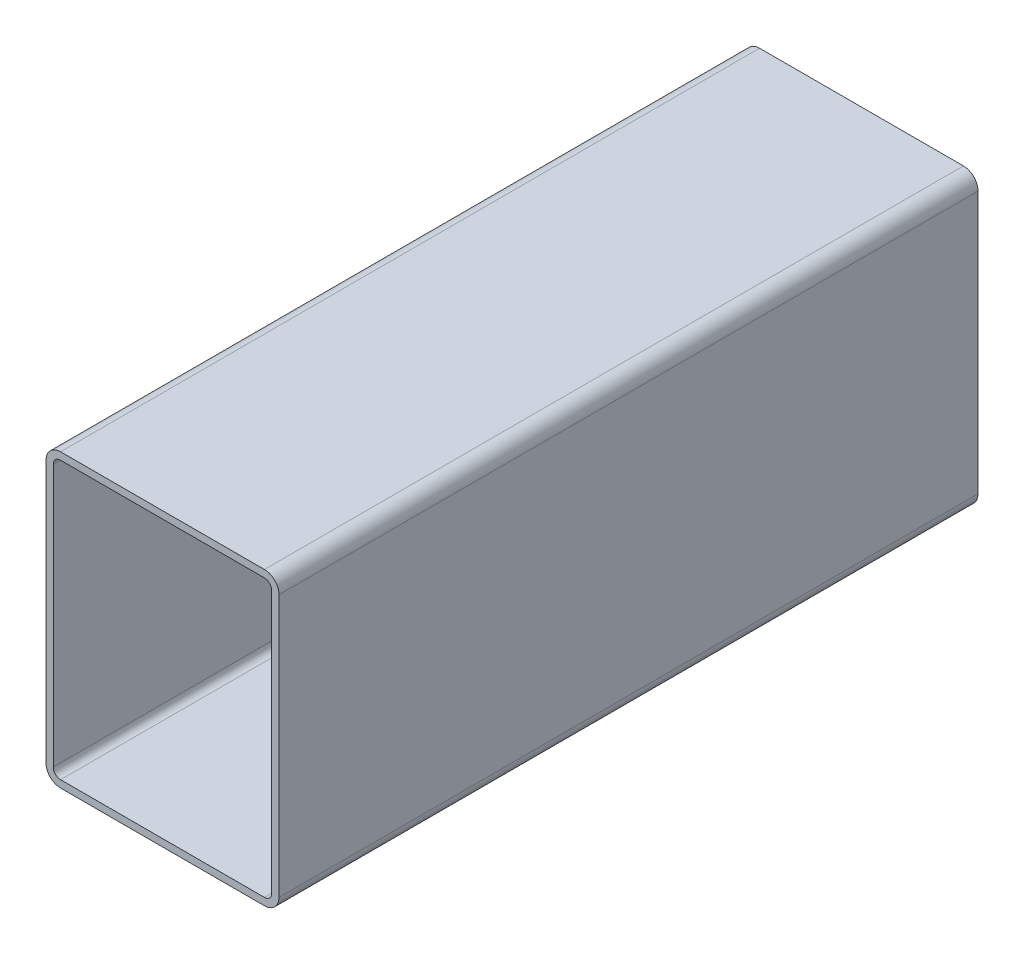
ISO-10303-21;
HEADER;
FILE_DESCRIPTION(('STEP AP214'),'2;1');
FILE_NAME('part.step','',(''),(''),'','','');
FILE_SCHEMA(('AUTOMOTIVE_DESIGN { 1 0 10303 214 1 1 1 1 }'));
ENDSEC;
DATA;
#1=APPLICATION_CONTEXT('core data for automotive mechanical design processes');
#2=APPLICATION_PROTOCOL_DEFINITION('international standard','automotive_design',2000,#1);
#3=PRODUCT_CONTEXT('',#1,'mechanical');
#4=PRODUCT('Part','Part','',(#3));
#5=PRODUCT_RELATED_PRODUCT_CATEGORY('part','',(#4));
#6=PRODUCT_DEFINITION_FORMATION('','',#4);
#7=PRODUCT_DEFINITION_CONTEXT('part definition',#1,'design');
#8=PRODUCT_DEFINITION('design','',#6,#7);
#9=PRODUCT_DEFINITION_SHAPE('','',#8);
#10=(LENGTH_UNIT() NAMED_UNIT(*) SI_UNIT(.MILLI.,.METRE.));
#11=(NAMED_UNIT(*) PLANE_ANGLE_UNIT() SI_UNIT($,.RADIAN.));
#12=(NAMED_UNIT(*) SI_UNIT($,.STERADIAN.) SOLID_ANGLE_UNIT());
#13=UNCERTAINTY_MEASURE_WITH_UNIT(LENGTH_MEASURE(1.E-05),#10,'distance_accuracy_value','');
#14=(GEOMETRIC_REPRESENTATION_CONTEXT(3) GLOBAL_UNCERTAINTY_ASSIGNED_CONTEXT((#13)) GLOBAL_UNIT_ASSIGNED_CONTEXT((#10,
#11,#12)) REPRESENTATION_CONTEXT('',''));
#15=CARTESIAN_POINT('',(0.,0.,0.));
#16=DIRECTION('',(0.,0.,1.));
#17=DIRECTION('',(1.,0.,0.));
#18=AXIS2_PLACEMENT_3D('',#15,#16,#17);
#19=CARTESIAN_POINT('',(8.02517782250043,122.68485662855,304.8));
#20=DIRECTION('',(0.,0.,1.));
#21=DIRECTION('',(1.,0.,0.));
#22=AXIS2_PLACEMENT_3D('',#19,#20,#21);
#23=PLANE('',#22);
#24=CARTESIAN_POINT('',(8.02517782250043,122.68485662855,304.8));
#25=DIRECTION('',(0.,0.,1.));
#26=DIRECTION('',(1.,0.,0.));
#27=AXIS2_PLACEMENT_3D('',#24,#25,#26);
#28=CIRCLE('',#27,6.35);
#29=CARTESIAN_POINT('',(8.02517782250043,129.03485662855,304.8));
#30=VERTEX_POINT('',#29);
#31=CARTESIAN_POINT('',(1.67517782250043,122.68485662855,304.8));
#32=VERTEX_POINT('',#31);
#33=EDGE_CURVE('E211',#30,#32,#28,.T.);
#34=ORIENTED_EDGE('',*,*,#33,.T.);
#35=DIRECTION('',(0.,-1.,0.));
#36=VECTOR('',#35,1.);
#37=CARTESIAN_POINT('',(1.67517782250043,8.38485662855,304.8));
#38=LINE('',#37,#36);
#39=CARTESIAN_POINT('',(1.67517782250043,8.38485662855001,304.8));
#40=VERTEX_POINT('',#39);
#41=EDGE_CURVE('E214',#32,#40,#38,.T.);
#42=ORIENTED_EDGE('',*,*,#41,.T.);
#43=CARTESIAN_POINT('',(8.02517782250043,8.38485662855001,304.8));
#44=DIRECTION('',(0.,0.,1.));
#45=DIRECTION('',(1.,0.,0.));
#46=AXIS2_PLACEMENT_3D('',#43,#44,#45);
#47=CIRCLE('',#46,6.35);
#48=CARTESIAN_POINT('',(8.02517782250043,2.03485662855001,304.8));
#49=VERTEX_POINT('',#48);
#50=EDGE_CURVE('E217',#40,#49,#47,.T.);
#51=ORIENTED_EDGE('',*,*,#50,.T.);
#52=DIRECTION('',(1.,0.,0.));
#53=VECTOR('',#52,1.);
#54=CARTESIAN_POINT('',(96.9251778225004,2.03485662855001,304.8));
#55=LINE('',#54,#53);
#56=CARTESIAN_POINT('',(96.9251778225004,2.03485662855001,304.8));
#57=VERTEX_POINT('',#56);
#58=EDGE_CURVE('E219',#49,#57,#55,.T.);
#59=ORIENTED_EDGE('',*,*,#58,.T.);
#60=CARTESIAN_POINT('',(96.9251778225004,8.38485662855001,304.8));
#61=DIRECTION('',(0.,0.,1.));
#62=DIRECTION('',(1.,0.,0.));
#63=AXIS2_PLACEMENT_3D('',#60,#61,#62);
#64=CIRCLE('',#63,6.35);
#65=CARTESIAN_POINT('',(103.2751778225,8.38485662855,304.8));
#66=VERTEX_POINT('',#65);
#67=EDGE_CURVE('E221',#57,#66,#64,.T.);
#68=ORIENTED_EDGE('',*,*,#67,.T.);
#69=DIRECTION('',(0.,1.,0.));
#70=VECTOR('',#69,1.);
#71=CARTESIAN_POINT('',(103.2751778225,122.68485662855,304.8));
#72=LINE('',#71,#70);
#73=CARTESIAN_POINT('',(103.2751778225,122.68485662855,304.8));
#74=VERTEX_POINT('',#73);
#75=EDGE_CURVE('E223',#66,#74,#72,.T.);
#76=ORIENTED_EDGE('',*,*,#75,.T.);
#77=CARTESIAN_POINT('',(96.9251778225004,122.68485662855,304.8));
#78=DIRECTION('',(0.,0.,1.));
#79=DIRECTION('',(1.,0.,0.));
#80=AXIS2_PLACEMENT_3D('',#77,#78,#79);
#81=CIRCLE('',#80,6.34999999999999);
#82=CARTESIAN_POINT('',(96.9251778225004,129.03485662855,304.8));
#83=VERTEX_POINT('',#82);
#84=EDGE_CURVE('E225',#74,#83,#81,.T.);
#85=ORIENTED_EDGE('',*,*,#84,.T.);
#86=DIRECTION('',(-1.,0.,0.));
#87=VECTOR('',#86,1.);
#88=CARTESIAN_POINT('',(8.02517782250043,129.03485662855,304.8));
#89=LINE('',#88,#87);
#90=EDGE_CURVE('E227',#83,#30,#89,.T.);
#91=ORIENTED_EDGE('',*,*,#90,.T.);
#92=EDGE_LOOP('',(#34,#42,#51,#59,#68,#76,#85,#91));
#93=FACE_BOUND('',#92,.T.);
#94=DIRECTION('',(0.,-1.,0.));
#95=VECTOR('',#94,1.);
#96=CARTESIAN_POINT('',(4.85017782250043,8.38485662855,304.8));
#97=LINE('',#96,#95);
#98=CARTESIAN_POINT('',(4.85017782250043,122.68485662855,304.8));
#99=VERTEX_POINT('',#98);
#100=CARTESIAN_POINT('',(4.85017782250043,8.38485662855,304.8));
#101=VERTEX_POINT('',#100);
#102=EDGE_CURVE('E154',#99,#101,#97,.T.);
#103=ORIENTED_EDGE('',*,*,#102,.F.);
#104=CARTESIAN_POINT('',(8.02517782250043,122.68485662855,304.8));
#105=DIRECTION('',(0.,0.,1.));
#106=DIRECTION('',(1.,0.,0.));
#107=AXIS2_PLACEMENT_3D('',#104,#105,#106);
#108=CIRCLE('',#107,3.17500000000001);
#109=CARTESIAN_POINT('',(8.02517782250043,125.85985662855,304.8));
#110=VERTEX_POINT('',#109);
#111=EDGE_CURVE('E146',#110,#99,#108,.T.);
#112=ORIENTED_EDGE('',*,*,#111,.F.);
#113=DIRECTION('',(-1.,0.,0.));
#114=VECTOR('',#113,1.);
#115=CARTESIAN_POINT('',(8.02517782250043,125.85985662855,304.8));
#116=LINE('',#115,#114);
#117=CARTESIAN_POINT('',(96.9251778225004,125.85985662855,304.8));
#118=VERTEX_POINT('',#117);
#119=EDGE_CURVE('E179',#118,#110,#116,.T.);
#120=ORIENTED_EDGE('',*,*,#119,.F.);
#121=CARTESIAN_POINT('',(96.9251778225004,122.68485662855,304.8));
#122=DIRECTION('',(0.,0.,1.));
#123=DIRECTION('',(1.,0.,0.));
#124=AXIS2_PLACEMENT_3D('',#121,#122,#123);
#125=CIRCLE('',#124,3.175);
#126=CARTESIAN_POINT('',(100.1001778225,122.68485662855,304.8));
#127=VERTEX_POINT('',#126);
#128=EDGE_CURVE('E177',#127,#118,#125,.T.);
#129=ORIENTED_EDGE('',*,*,#128,.F.);
#130=DIRECTION('',(0.,1.,0.));
#131=VECTOR('',#130,1.);
#132=CARTESIAN_POINT('',(100.1001778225,122.68485662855,304.8));
#133=LINE('',#132,#131);
#134=CARTESIAN_POINT('',(100.1001778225,8.38485662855,304.8));
#135=VERTEX_POINT('',#134);
#136=EDGE_CURVE('E175',#135,#127,#133,.T.);
#137=ORIENTED_EDGE('',*,*,#136,.F.);
#138=CARTESIAN_POINT('',(96.9251778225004,8.38485662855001,304.8));
#139=DIRECTION('',(0.,0.,1.));
#140=DIRECTION('',(1.,0.,0.));
#141=AXIS2_PLACEMENT_3D('',#138,#139,#140);
#142=CIRCLE('',#141,3.175);
#143=CARTESIAN_POINT('',(96.9251778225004,5.20985662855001,304.8));
#144=VERTEX_POINT('',#143);
#145=EDGE_CURVE('E173',#144,#135,#142,.T.);
#146=ORIENTED_EDGE('',*,*,#145,.F.);
#147=DIRECTION('',(1.,0.,0.));
#148=VECTOR('',#147,1.);
#149=CARTESIAN_POINT('',(96.9251778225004,5.20985662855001,304.8));
#150=LINE('',#149,#148);
#151=CARTESIAN_POINT('',(8.02517782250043,5.20985662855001,304.8));
#152=VERTEX_POINT('',#151);
#153=EDGE_CURVE('E169',#152,#144,#150,.T.);
#154=ORIENTED_EDGE('',*,*,#153,.F.);
#155=CARTESIAN_POINT('',(8.02517782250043,8.38485662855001,304.8));
#156=DIRECTION('',(0.,0.,1.));
#157=DIRECTION('',(1.,0.,0.));
#158=AXIS2_PLACEMENT_3D('',#155,#156,#157);
#159=CIRCLE('',#158,3.175);
#160=EDGE_CURVE('E167',#101,#152,#159,.T.);
#161=ORIENTED_EDGE('',*,*,#160,.F.);
#162=EDGE_LOOP('',(#103,#112,#120,#129,#137,#146,#154,#161));
#163=FACE_BOUND('',#162,.T.);
#164=ADVANCED_FACE('F33',(#93,#163),#23,.T.);
#165=CARTESIAN_POINT('',(8.02517782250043,122.68485662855,0.));
#166=DIRECTION('',(0.,0.,1.));
#167=DIRECTION('',(1.,0.,0.));
#168=AXIS2_PLACEMENT_3D('',#165,#166,#167);
#169=PLANE('',#168);
#170=CARTESIAN_POINT('',(8.02517782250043,122.68485662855,0.));
#171=DIRECTION('',(0.,0.,1.));
#172=DIRECTION('',(1.,0.,0.));
#173=AXIS2_PLACEMENT_3D('',#170,#171,#172);
#174=CIRCLE('',#173,6.35);
#175=CARTESIAN_POINT('',(8.02517782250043,129.03485662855,0.));
#176=VERTEX_POINT('',#175);
#177=CARTESIAN_POINT('',(1.67517782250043,122.68485662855,0.));
#178=VERTEX_POINT('',#177);
#179=EDGE_CURVE('E162',#176,#178,#174,.T.);
#180=ORIENTED_EDGE('',*,*,#179,.F.);
#181=DIRECTION('',(-1.,0.,0.));
#182=VECTOR('',#181,1.);
#183=CARTESIAN_POINT('',(8.02517782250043,129.03485662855,0.));
#184=LINE('',#183,#182);
#185=CARTESIAN_POINT('',(96.9251778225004,129.03485662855,0.));
#186=VERTEX_POINT('',#185);
#187=EDGE_CURVE('E215',#186,#176,#184,.T.);
#188=ORIENTED_EDGE('',*,*,#187,.F.);
#189=CARTESIAN_POINT('',(96.9251778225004,122.68485662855,0.));
#190=DIRECTION('',(0.,0.,1.));
#191=DIRECTION('',(1.,0.,0.));
#192=AXIS2_PLACEMENT_3D('',#189,#190,#191);
#193=CIRCLE('',#192,6.34999999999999);
#194=CARTESIAN_POINT('',(103.2751778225,122.68485662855,0.));
#195=VERTEX_POINT('',#194);
#196=EDGE_CURVE('E242',#195,#186,#193,.T.);
#197=ORIENTED_EDGE('',*,*,#196,.F.);
#198=DIRECTION('',(0.,1.,0.));
#199=VECTOR('',#198,1.);
#200=CARTESIAN_POINT('',(103.2751778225,122.68485662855,0.));
#201=LINE('',#200,#199);
#202=CARTESIAN_POINT('',(103.2751778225,8.38485662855,0.));
#203=VERTEX_POINT('',#202);
#204=EDGE_CURVE('E240',#203,#195,#201,.T.);
#205=ORIENTED_EDGE('',*,*,#204,.F.);
#206=CARTESIAN_POINT('',(96.9251778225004,8.38485662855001,0.));
#207=DIRECTION('',(0.,0.,1.));
#208=DIRECTION('',(1.,0.,0.));
#209=AXIS2_PLACEMENT_3D('',#206,#207,#208);
#210=CIRCLE('',#209,6.35);
#211=CARTESIAN_POINT('',(96.9251778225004,2.03485662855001,0.));
#212=VERTEX_POINT('',#211);
#213=EDGE_CURVE('E238',#212,#203,#210,.T.);
#214=ORIENTED_EDGE('',*,*,#213,.F.);
#215=DIRECTION('',(1.,0.,0.));
#216=VECTOR('',#215,1.);
#217=CARTESIAN_POINT('',(96.9251778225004,2.03485662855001,0.));
#218=LINE('',#217,#216);
#219=CARTESIAN_POINT('',(8.02517782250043,2.03485662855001,0.));
#220=VERTEX_POINT('',#219);
#221=EDGE_CURVE('E236',#220,#212,#218,.T.);
#222=ORIENTED_EDGE('',*,*,#221,.F.);
#223=CARTESIAN_POINT('',(8.02517782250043,8.38485662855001,0.));
#224=DIRECTION('',(0.,0.,1.));
#225=DIRECTION('',(1.,0.,0.));
#226=AXIS2_PLACEMENT_3D('',#223,#224,#225);
#227=CIRCLE('',#226,6.35);
#228=CARTESIAN_POINT('',(1.67517782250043,8.38485662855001,0.));
#229=VERTEX_POINT('',#228);
#230=EDGE_CURVE('E234',#229,#220,#227,.T.);
#231=ORIENTED_EDGE('',*,*,#230,.F.);
#232=DIRECTION('',(0.,-1.,0.));
#233=VECTOR('',#232,1.);
#234=CARTESIAN_POINT('',(1.67517782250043,8.38485662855,0.));
#235=LINE('',#234,#233);
#236=EDGE_CURVE('E232',#178,#229,#235,.T.);
#237=ORIENTED_EDGE('',*,*,#236,.F.);
#238=EDGE_LOOP('',(#180,#188,#197,#205,#214,#222,#231,#237));
#239=FACE_BOUND('',#238,.T.);
#240=CARTESIAN_POINT('',(8.02517782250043,122.68485662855,0.));
#241=DIRECTION('',(0.,0.,1.));
#242=DIRECTION('',(1.,0.,0.));
#243=AXIS2_PLACEMENT_3D('',#240,#241,#242);
#244=CIRCLE('',#243,3.17500000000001);
#245=CARTESIAN_POINT('',(8.02517782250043,125.85985662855,0.));
#246=VERTEX_POINT('',#245);
#247=CARTESIAN_POINT('',(4.85017782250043,122.68485662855,0.));
#248=VERTEX_POINT('',#247);
#249=EDGE_CURVE('E56',#246,#248,#244,.T.);
#250=ORIENTED_EDGE('',*,*,#249,.T.);
#251=DIRECTION('',(0.,-1.,0.));
#252=VECTOR('',#251,1.);
#253=CARTESIAN_POINT('',(4.85017782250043,8.38485662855,0.));
#254=LINE('',#253,#252);
#255=CARTESIAN_POINT('',(4.85017782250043,8.38485662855,0.));
#256=VERTEX_POINT('',#255);
#257=EDGE_CURVE('E161',#248,#256,#254,.T.);
#258=ORIENTED_EDGE('',*,*,#257,.T.);
#259=CARTESIAN_POINT('',(8.02517782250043,8.38485662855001,0.));
#260=DIRECTION('',(0.,0.,1.));
#261=DIRECTION('',(1.,0.,0.));
#262=AXIS2_PLACEMENT_3D('',#259,#260,#261);
#263=CIRCLE('',#262,3.175);
#264=CARTESIAN_POINT('',(8.02517782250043,5.20985662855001,0.));
#265=VERTEX_POINT('',#264);
#266=EDGE_CURVE('E183',#256,#265,#263,.T.);
#267=ORIENTED_EDGE('',*,*,#266,.T.);
#268=DIRECTION('',(1.,0.,0.));
#269=VECTOR('',#268,1.);
#270=CARTESIAN_POINT('',(96.9251778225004,5.20985662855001,0.));
#271=LINE('',#270,#269);
#272=CARTESIAN_POINT('',(96.9251778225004,5.20985662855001,0.));
#273=VERTEX_POINT('',#272);
#274=EDGE_CURVE('E186',#265,#273,#271,.T.);
#275=ORIENTED_EDGE('',*,*,#274,.T.);
#276=CARTESIAN_POINT('',(96.9251778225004,8.38485662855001,0.));
#277=DIRECTION('',(0.,0.,1.));
#278=DIRECTION('',(1.,0.,0.));
#279=AXIS2_PLACEMENT_3D('',#276,#277,#278);
#280=CIRCLE('',#279,3.175);
#281=CARTESIAN_POINT('',(100.1001778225,8.38485662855,0.));
#282=VERTEX_POINT('',#281);
#283=EDGE_CURVE('E189',#273,#282,#280,.T.);
#284=ORIENTED_EDGE('',*,*,#283,.T.);
#285=DIRECTION('',(0.,1.,0.));
#286=VECTOR('',#285,1.);
#287=CARTESIAN_POINT('',(100.1001778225,122.68485662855,0.));
#288=LINE('',#287,#286);
#289=CARTESIAN_POINT('',(100.1001778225,122.68485662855,0.));
#290=VERTEX_POINT('',#289);
#291=EDGE_CURVE('E192',#282,#290,#288,.T.);
#292=ORIENTED_EDGE('',*,*,#291,.T.);
#293=CARTESIAN_POINT('',(96.9251778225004,122.68485662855,0.));
#294=DIRECTION('',(0.,0.,1.));
#295=DIRECTION('',(1.,0.,0.));
#296=AXIS2_PLACEMENT_3D('',#293,#294,#295);
#297=CIRCLE('',#296,3.175);
#298=CARTESIAN_POINT('',(96.9251778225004,125.85985662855,0.));
#299=VERTEX_POINT('',#298);
#300=EDGE_CURVE('E195',#290,#299,#297,.T.);
#301=ORIENTED_EDGE('',*,*,#300,.T.);
#302=DIRECTION('',(-1.,0.,0.));
#303=VECTOR('',#302,1.);
#304=CARTESIAN_POINT('',(8.02517782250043,125.85985662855,0.));
#305=LINE('',#304,#303);
#306=EDGE_CURVE('E155',#299,#246,#305,.T.);
#307=ORIENTED_EDGE('',*,*,#306,.T.);
#308=EDGE_LOOP('',(#250,#258,#267,#275,#284,#292,#301,#307));
#309=FACE_BOUND('',#308,.T.);
#310=ADVANCED_FACE('F272',(#239,#309),#169,.F.);
#311=CARTESIAN_POINT('',(8.02517782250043,122.68485662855,304.8));
#312=DIRECTION('',(0.,0.,-1.));
#313=DIRECTION('',(-1.,0.,0.));
#314=AXIS2_PLACEMENT_3D('',#311,#312,#313);
#315=CYLINDRICAL_SURFACE('',#314,6.35);
#316=ORIENTED_EDGE('',*,*,#179,.T.);
#317=DIRECTION('',(0.,0.,-1.));
#318=VECTOR('',#317,1.);
#319=CARTESIAN_POINT('',(1.67517782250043,122.68485662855,304.8));
#320=LINE('',#319,#318);
#321=EDGE_CURVE('E11',#32,#178,#320,.T.);
#322=ORIENTED_EDGE('',*,*,#321,.F.);
#323=ORIENTED_EDGE('',*,*,#33,.F.);
#324=DIRECTION('',(0.,0.,-1.));
#325=VECTOR('',#324,1.);
#326=CARTESIAN_POINT('',(8.02517782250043,129.03485662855,304.8));
#327=LINE('',#326,#325);
#328=EDGE_CURVE('E229',#30,#176,#327,.T.);
#329=ORIENTED_EDGE('',*,*,#328,.T.);
#330=EDGE_LOOP('',(#316,#322,#323,#329));
#331=FACE_BOUND('',#330,.T.);
#332=ADVANCED_FACE('F35',(#331),#315,.T.);
#333=CARTESIAN_POINT('',(1.67517782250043,8.38485662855,304.8));
#334=DIRECTION('',(1.,0.,0.));
#335=DIRECTION('',(0.,0.,-1.));
#336=AXIS2_PLACEMENT_3D('',#333,#334,#335);
#337=PLANE('',#336);
#338=ORIENTED_EDGE('',*,*,#236,.T.);
#339=DIRECTION('',(0.,0.,-1.));
#340=VECTOR('',#339,1.);
#341=CARTESIAN_POINT('',(1.67517782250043,8.38485662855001,304.8));
#342=LINE('',#341,#340);
#343=EDGE_CURVE('E41',#40,#229,#342,.T.);
#344=ORIENTED_EDGE('',*,*,#343,.F.);
#345=ORIENTED_EDGE('',*,*,#41,.F.);
#346=ORIENTED_EDGE('',*,*,#321,.T.);
#347=EDGE_LOOP('',(#338,#344,#345,#346));
#348=FACE_BOUND('',#347,.T.);
#349=ADVANCED_FACE('F289',(#348),#337,.F.);
#350=CARTESIAN_POINT('',(8.02517782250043,8.38485662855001,304.8));
#351=DIRECTION('',(0.,0.,-1.));
#352=DIRECTION('',(-1.,0.,0.));
#353=AXIS2_PLACEMENT_3D('',#350,#351,#352);
#354=CYLINDRICAL_SURFACE('',#353,6.35);
#355=ORIENTED_EDGE('',*,*,#230,.T.);
#356=DIRECTION('',(0.,0.,-1.));
#357=VECTOR('',#356,1.);
#358=CARTESIAN_POINT('',(8.02517782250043,2.03485662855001,304.8));
#359=LINE('',#358,#357);
#360=EDGE_CURVE('E259',#49,#220,#359,.T.);
#361=ORIENTED_EDGE('',*,*,#360,.F.);
#362=ORIENTED_EDGE('',*,*,#50,.F.);
#363=ORIENTED_EDGE('',*,*,#343,.T.);
#364=EDGE_LOOP('',(#355,#361,#362,#363));
#365=FACE_BOUND('',#364,.T.);
#366=ADVANCED_FACE('F266',(#365),#354,.T.);
#367=CARTESIAN_POINT('',(96.9251778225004,2.03485662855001,304.8));
#368=DIRECTION('',(0.,1.,0.));
#369=DIRECTION('',(0.,0.,1.));
#370=AXIS2_PLACEMENT_3D('',#367,#368,#369);
#371=PLANE('',#370);
#372=ORIENTED_EDGE('',*,*,#221,.T.);
#373=DIRECTION('',(0.,0.,-1.));
#374=VECTOR('',#373,1.);
#375=CARTESIAN_POINT('',(96.9251778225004,2.03485662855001,304.8));
#376=LINE('',#375,#374);
#377=EDGE_CURVE('E256',#57,#212,#376,.T.);
#378=ORIENTED_EDGE('',*,*,#377,.F.);
#379=ORIENTED_EDGE('',*,*,#58,.F.);
#380=ORIENTED_EDGE('',*,*,#360,.T.);
#381=EDGE_LOOP('',(#372,#378,#379,#380));
#382=FACE_BOUND('',#381,.T.);
#383=ADVANCED_FACE('F278',(#382),#371,.F.);
#384=CARTESIAN_POINT('',(96.9251778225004,8.38485662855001,304.8));
#385=DIRECTION('',(0.,0.,-1.));
#386=DIRECTION('',(-1.,0.,0.));
#387=AXIS2_PLACEMENT_3D('',#384,#385,#386);
#388=CYLINDRICAL_SURFACE('',#387,6.35);
#389=ORIENTED_EDGE('',*,*,#213,.T.);
#390=DIRECTION('',(0.,0.,-1.));
#391=VECTOR('',#390,1.);
#392=CARTESIAN_POINT('',(103.2751778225,8.38485662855,304.8));
#393=LINE('',#392,#391);
#394=EDGE_CURVE('E253',#66,#203,#393,.T.);
#395=ORIENTED_EDGE('',*,*,#394,.F.);
#396=ORIENTED_EDGE('',*,*,#67,.F.);
#397=ORIENTED_EDGE('',*,*,#377,.T.);
#398=EDGE_LOOP('',(#389,#395,#396,#397));
#399=FACE_BOUND('',#398,.T.);
#400=ADVANCED_FACE('F282',(#399),#388,.T.);
#401=CARTESIAN_POINT('',(103.2751778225,122.68485662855,304.8));
#402=DIRECTION('',(-1.,0.,0.));
#403=DIRECTION('',(0.,0.,1.));
#404=AXIS2_PLACEMENT_3D('',#401,#402,#403);
#405=PLANE('',#404);
#406=ORIENTED_EDGE('',*,*,#204,.T.);
#407=DIRECTION('',(0.,0.,-1.));
#408=VECTOR('',#407,1.);
#409=CARTESIAN_POINT('',(103.2751778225,122.68485662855,304.8));
#410=LINE('',#409,#408);
#411=EDGE_CURVE('E250',#74,#195,#410,.T.);
#412=ORIENTED_EDGE('',*,*,#411,.F.);
#413=ORIENTED_EDGE('',*,*,#75,.F.);
#414=ORIENTED_EDGE('',*,*,#394,.T.);
#415=EDGE_LOOP('',(#406,#412,#413,#414));
#416=FACE_BOUND('',#415,.T.);
#417=ADVANCED_FACE('F302',(#416),#405,.F.);
#418=CARTESIAN_POINT('',(96.9251778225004,122.68485662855,304.8));
#419=DIRECTION('',(0.,0.,-1.));
#420=DIRECTION('',(-1.,0.,0.));
#421=AXIS2_PLACEMENT_3D('',#418,#419,#420);
#422=CYLINDRICAL_SURFACE('',#421,6.34999999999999);
#423=ORIENTED_EDGE('',*,*,#196,.T.);
#424=DIRECTION('',(0.,0.,-1.));
#425=VECTOR('',#424,1.);
#426=CARTESIAN_POINT('',(96.9251778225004,129.03485662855,304.8));
#427=LINE('',#426,#425);
#428=EDGE_CURVE('E247',#83,#186,#427,.T.);
#429=ORIENTED_EDGE('',*,*,#428,.F.);
#430=ORIENTED_EDGE('',*,*,#84,.F.);
#431=ORIENTED_EDGE('',*,*,#411,.T.);
#432=EDGE_LOOP('',(#423,#429,#430,#431));
#433=FACE_BOUND('',#432,.T.);
#434=ADVANCED_FACE('F300',(#433),#422,.T.);
#435=CARTESIAN_POINT('',(8.02517782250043,129.03485662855,304.8));
#436=DIRECTION('',(0.,-1.,0.));
#437=DIRECTION('',(0.,0.,-1.));
#438=AXIS2_PLACEMENT_3D('',#435,#436,#437);
#439=PLANE('',#438);
#440=ORIENTED_EDGE('',*,*,#187,.T.);
#441=ORIENTED_EDGE('',*,*,#328,.F.);
#442=ORIENTED_EDGE('',*,*,#90,.F.);
#443=ORIENTED_EDGE('',*,*,#428,.T.);
#444=EDGE_LOOP('',(#440,#441,#442,#443));
#445=FACE_BOUND('',#444,.T.);
#446=ADVANCED_FACE('F295',(#445),#439,.F.);
#447=CARTESIAN_POINT('',(8.02517782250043,122.68485662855,304.8));
#448=DIRECTION('',(0.,0.,-1.));
#449=DIRECTION('',(-1.,0.,0.));
#450=AXIS2_PLACEMENT_3D('',#447,#448,#449);
#451=CYLINDRICAL_SURFACE('',#450,3.17500000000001);
#452=ORIENTED_EDGE('',*,*,#249,.F.);
#453=DIRECTION('',(0.,0.,-1.));
#454=VECTOR('',#453,1.);
#455=CARTESIAN_POINT('',(8.02517782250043,125.85985662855,304.8));
#456=LINE('',#455,#454);
#457=EDGE_CURVE('E150',#110,#246,#456,.T.);
#458=ORIENTED_EDGE('',*,*,#457,.F.);
#459=ORIENTED_EDGE('',*,*,#111,.T.);
#460=DIRECTION('',(0.,0.,-1.));
#461=VECTOR('',#460,1.);
#462=CARTESIAN_POINT('',(4.85017782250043,122.68485662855,304.8));
#463=LINE('',#462,#461);
#464=EDGE_CURVE('E149',#99,#248,#463,.T.);
#465=ORIENTED_EDGE('',*,*,#464,.T.);
#466=EDGE_LOOP('',(#452,#458,#459,#465));
#467=FACE_BOUND('',#466,.T.);
#468=ADVANCED_FACE('F148',(#467),#451,.F.);
#469=CARTESIAN_POINT('',(4.85017782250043,8.38485662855,304.8));
#470=DIRECTION('',(1.,0.,0.));
#471=DIRECTION('',(0.,0.,-1.));
#472=AXIS2_PLACEMENT_3D('',#469,#470,#471);
#473=PLANE('',#472);
#474=ORIENTED_EDGE('',*,*,#257,.F.);
#475=ORIENTED_EDGE('',*,*,#464,.F.);
#476=ORIENTED_EDGE('',*,*,#102,.T.);
#477=DIRECTION('',(0.,0.,-1.));
#478=VECTOR('',#477,1.);
#479=CARTESIAN_POINT('',(4.85017782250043,8.38485662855,304.8));
#480=LINE('',#479,#478);
#481=EDGE_CURVE('E163',#101,#256,#480,.T.);
#482=ORIENTED_EDGE('',*,*,#481,.T.);
#483=EDGE_LOOP('',(#474,#475,#476,#482));
#484=FACE_BOUND('',#483,.T.);
#485=ADVANCED_FACE('F158',(#484),#473,.T.);
#486=CARTESIAN_POINT('',(8.02517782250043,8.38485662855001,304.8));
#487=DIRECTION('',(0.,0.,-1.));
#488=DIRECTION('',(-1.,0.,0.));
#489=AXIS2_PLACEMENT_3D('',#486,#487,#488);
#490=CYLINDRICAL_SURFACE('',#489,3.175);
#491=ORIENTED_EDGE('',*,*,#266,.F.);
#492=ORIENTED_EDGE('',*,*,#481,.F.);
#493=ORIENTED_EDGE('',*,*,#160,.T.);
#494=DIRECTION('',(0.,0.,-1.));
#495=VECTOR('',#494,1.);
#496=CARTESIAN_POINT('',(8.02517782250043,5.20985662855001,304.8));
#497=LINE('',#496,#495);
#498=EDGE_CURVE('E208',#152,#265,#497,.T.);
#499=ORIENTED_EDGE('',*,*,#498,.T.);
#500=EDGE_LOOP('',(#491,#492,#493,#499));
#501=FACE_BOUND('',#500,.T.);
#502=ADVANCED_FACE('F327',(#501),#490,.F.);
#503=CARTESIAN_POINT('',(96.9251778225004,5.20985662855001,304.8));
#504=DIRECTION('',(0.,1.,0.));
#505=DIRECTION('',(0.,0.,1.));
#506=AXIS2_PLACEMENT_3D('',#503,#504,#505);
#507=PLANE('',#506);
#508=ORIENTED_EDGE('',*,*,#274,.F.);
#509=ORIENTED_EDGE('',*,*,#498,.F.);
#510=ORIENTED_EDGE('',*,*,#153,.T.);
#511=DIRECTION('',(0.,0.,-1.));
#512=VECTOR('',#511,1.);
#513=CARTESIAN_POINT('',(96.9251778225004,5.20985662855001,304.8));
#514=LINE('',#513,#512);
#515=EDGE_CURVE('E206',#144,#273,#514,.T.);
#516=ORIENTED_EDGE('',*,*,#515,.T.);
#517=EDGE_LOOP('',(#508,#509,#510,#516));
#518=FACE_BOUND('',#517,.T.);
#519=ADVANCED_FACE('F331',(#518),#507,.T.);
#520=CARTESIAN_POINT('',(96.9251778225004,8.38485662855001,304.8));
#521=DIRECTION('',(0.,0.,-1.));
#522=DIRECTION('',(-1.,0.,0.));
#523=AXIS2_PLACEMENT_3D('',#520,#521,#522);
#524=CYLINDRICAL_SURFACE('',#523,3.175);
#525=ORIENTED_EDGE('',*,*,#283,.F.);
#526=ORIENTED_EDGE('',*,*,#515,.F.);
#527=ORIENTED_EDGE('',*,*,#145,.T.);
#528=DIRECTION('',(0.,0.,-1.));
#529=VECTOR('',#528,1.);
#530=CARTESIAN_POINT('',(100.1001778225,8.38485662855,304.8));
#531=LINE('',#530,#529);
#532=EDGE_CURVE('E204',#135,#282,#531,.T.);
#533=ORIENTED_EDGE('',*,*,#532,.T.);
#534=EDGE_LOOP('',(#525,#526,#527,#533));
#535=FACE_BOUND('',#534,.T.);
#536=ADVANCED_FACE('F337',(#535),#524,.F.);
#537=CARTESIAN_POINT('',(100.1001778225,122.68485662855,304.8));
#538=DIRECTION('',(-1.,0.,0.));
#539=DIRECTION('',(0.,0.,1.));
#540=AXIS2_PLACEMENT_3D('',#537,#538,#539);
#541=PLANE('',#540);
#542=ORIENTED_EDGE('',*,*,#291,.F.);
#543=ORIENTED_EDGE('',*,*,#532,.F.);
#544=ORIENTED_EDGE('',*,*,#136,.T.);
#545=DIRECTION('',(0.,0.,-1.));
#546=VECTOR('',#545,1.);
#547=CARTESIAN_POINT('',(100.1001778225,122.68485662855,304.8));
#548=LINE('',#547,#546);
#549=EDGE_CURVE('E202',#127,#290,#548,.T.);
#550=ORIENTED_EDGE('',*,*,#549,.T.);
#551=EDGE_LOOP('',(#542,#543,#544,#550));
#552=FACE_BOUND('',#551,.T.);
#553=ADVANCED_FACE('F341',(#552),#541,.T.);
#554=CARTESIAN_POINT('',(96.9251778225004,122.68485662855,304.8));
#555=DIRECTION('',(0.,0.,-1.));
#556=DIRECTION('',(-1.,0.,0.));
#557=AXIS2_PLACEMENT_3D('',#554,#555,#556);
#558=CYLINDRICAL_SURFACE('',#557,3.175);
#559=ORIENTED_EDGE('',*,*,#300,.F.);
#560=ORIENTED_EDGE('',*,*,#549,.F.);
#561=ORIENTED_EDGE('',*,*,#128,.T.);
#562=DIRECTION('',(0.,0.,-1.));
#563=VECTOR('',#562,1.);
#564=CARTESIAN_POINT('',(96.9251778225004,125.85985662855,304.8));
#565=LINE('',#564,#563);
#566=EDGE_CURVE('E48',#118,#299,#565,.T.);
#567=ORIENTED_EDGE('',*,*,#566,.T.);
#568=EDGE_LOOP('',(#559,#560,#561,#567));
#569=FACE_BOUND('',#568,.T.);
#570=ADVANCED_FACE('F345',(#569),#558,.F.);
#571=CARTESIAN_POINT('',(8.02517782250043,125.85985662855,304.8));
#572=DIRECTION('',(0.,-1.,0.));
#573=DIRECTION('',(0.,0.,-1.));
#574=AXIS2_PLACEMENT_3D('',#571,#572,#573);
#575=PLANE('',#574);
#576=ORIENTED_EDGE('',*,*,#306,.F.);
#577=ORIENTED_EDGE('',*,*,#566,.F.);
#578=ORIENTED_EDGE('',*,*,#119,.T.);
#579=ORIENTED_EDGE('',*,*,#457,.T.);
#580=EDGE_LOOP('',(#576,#577,#578,#579));
#581=FACE_BOUND('',#580,.T.);
#582=ADVANCED_FACE('F349',(#581),#575,.T.);
#583=CLOSED_SHELL('',(#164,#310,#332,#349,#366,#383,#400,#417,#434,#446,#468,#485,#502,#519,
#536,#553,#570,#582));
#584=MANIFOLD_SOLID_BREP('B2',#583);
#585=ADVANCED_BREP_SHAPE_REPRESENTATION('',(#18,#584),#14);
#586=SHAPE_DEFINITION_REPRESENTATION(#9,#585);
ENDSEC;
END-ISO-10303-21;
